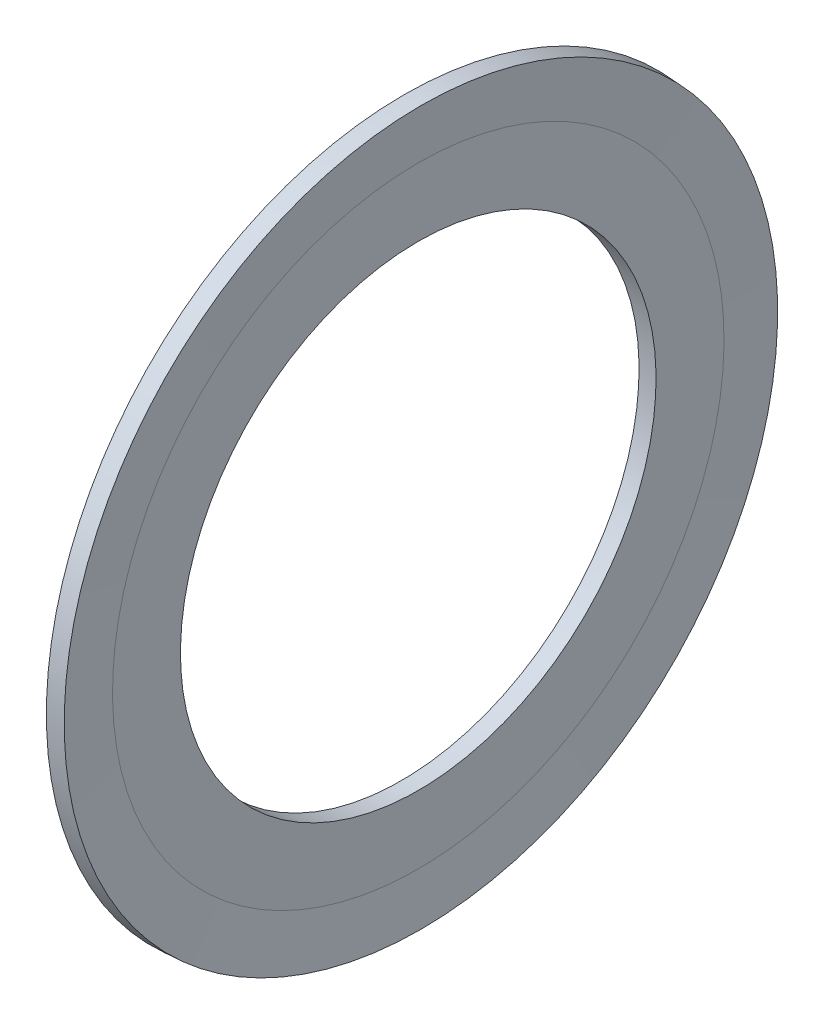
from build123d import *


with BuildPart() as part:
    # Esquisse1 → Base-R_volution (revolve)
    with BuildSketch(Plane.XY):
        Polygon((0, 14), (0, 18), (0.157223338, 21), (-0.841406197, 21.052335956), (-1, 18.026185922), (-1, 14), align=None)
    revolve(axis=Axis((20, 0, 0), (-1, 0, 0)))


solid = part.part
